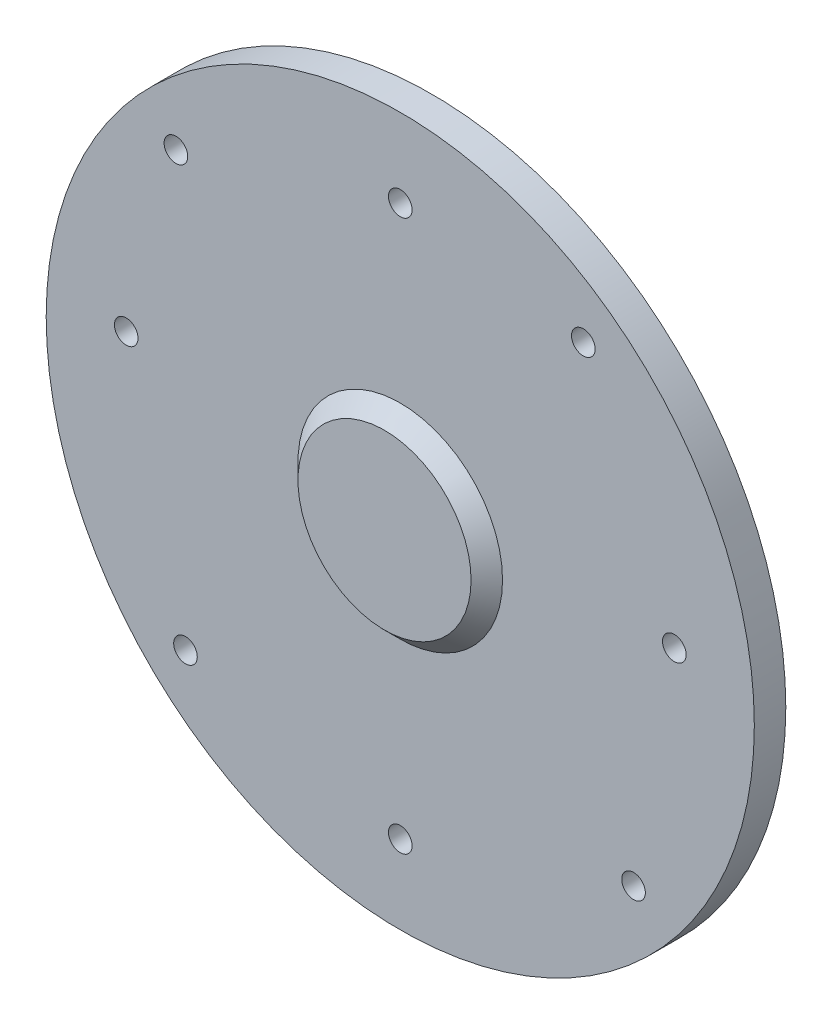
from build123d import *

# Parameters (mm, degrees)
ESQUISSE1_R             = 22.5
EXTRUSION1_DEPTH        = 2
ESQUISSE2_R             = 6.5
EXTRUSION2_DEPTH        = 1
EXTRUSION2_TAPER        = 45
ESQUISSE3_R             = 6.5
EXTRUSION3_DEPTH        = 1
EXTRUSION3_TAPER        = 45
ESQUISSE4_R             = 5
EXTRUSION4_DEPTH        = 1
ESQUISSE5_R             = 5
EXTRUSION5_DEPTH        = 1.5
EXTRUSION5_TAPER        = 45
ESQUISSE6_R             = 0.75
ENL_V_MAT_EXTRU_1_DEPTH = 33.291639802
ESQUISSE7_R             = 2.9
EXTRUSION6_DEPTH        = 2.7


with BuildPart() as part:
    # Esquisse1 → Extrusion1 (new body)
    with BuildSketch(Plane.XY):
        Circle(ESQUISSE1_R)
    extrude(amount=EXTRUSION1_DEPTH)

    # Esquisse2 → Extrusion2 (add)
    with BuildSketch(Plane.XY.offset(2)):
        Circle(ESQUISSE2_R)
    extrude(amount=EXTRUSION2_DEPTH, taper=EXTRUSION2_TAPER)

    # Esquisse3 → Extrusion3 (add)
    with BuildSketch(Plane(origin=(0, 0, 0), x_dir=(-1, 0, 0), z_dir=(0, 0, -1))):
        Circle(ESQUISSE3_R)
    extrude(amount=EXTRUSION3_DEPTH, taper=EXTRUSION3_TAPER)

    # Esquisse4 → Extrusion4 (add)
    with BuildSketch(Plane(origin=(0, 0, -1), x_dir=(-1, 0, 0), z_dir=(0, 0, -1))):
        Circle(ESQUISSE4_R)
    extrude(amount=EXTRUSION4_DEPTH)

    # Esquisse5 → Extrusion5 (add)
    with BuildSketch(Plane(origin=(0, 0, -2), x_dir=(-1, 0, 0), z_dir=(0, 0, -1))):
        Circle(ESQUISSE5_R)
    extrude(amount=EXTRUSION5_DEPTH, taper=EXTRUSION5_TAPER)

    # Esquisse6 → Enl_v. mat.-Extru.1 (cut, through all)
    with BuildSketch(Plane.XY.offset(2)):
        with Locations((0, 17.5)):
            Circle(ESQUISSE6_R)
        with Locations((-17.414982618, 1.722898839)):
            Circle(ESQUISSE6_R)
        with Locations((0, -17.5)):
            Circle(ESQUISSE6_R)
        with Locations((17.414982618, 1.722898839)):
            Circle(ESQUISSE6_R)
        with Locations((-14.256754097, 13.303945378)):
            Circle(ESQUISSE6_R)
        with Locations((11.631848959, 15.650881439)):
            Circle(ESQUISSE6_R)
        with Locations((14.823494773, -12.66941209)):
            Circle(ESQUISSE6_R)
        with Locations((-13.64829757, -13.927453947)):
            Circle(ESQUISSE6_R)
    extrude(amount=-ENL_V_MAT_EXTRU_1_DEPTH, mode=Mode.SUBTRACT)

    # Esquisse7 → Extrusion6 (cut)
    with BuildSketch(Plane(origin=(0, 0, -3.5), x_dir=(-1, 0, 0), z_dir=(0, 0, -1))):
        Circle(ESQUISSE7_R)
    extrude(amount=-EXTRUSION6_DEPTH, mode=Mode.SUBTRACT)


solid = part.part
